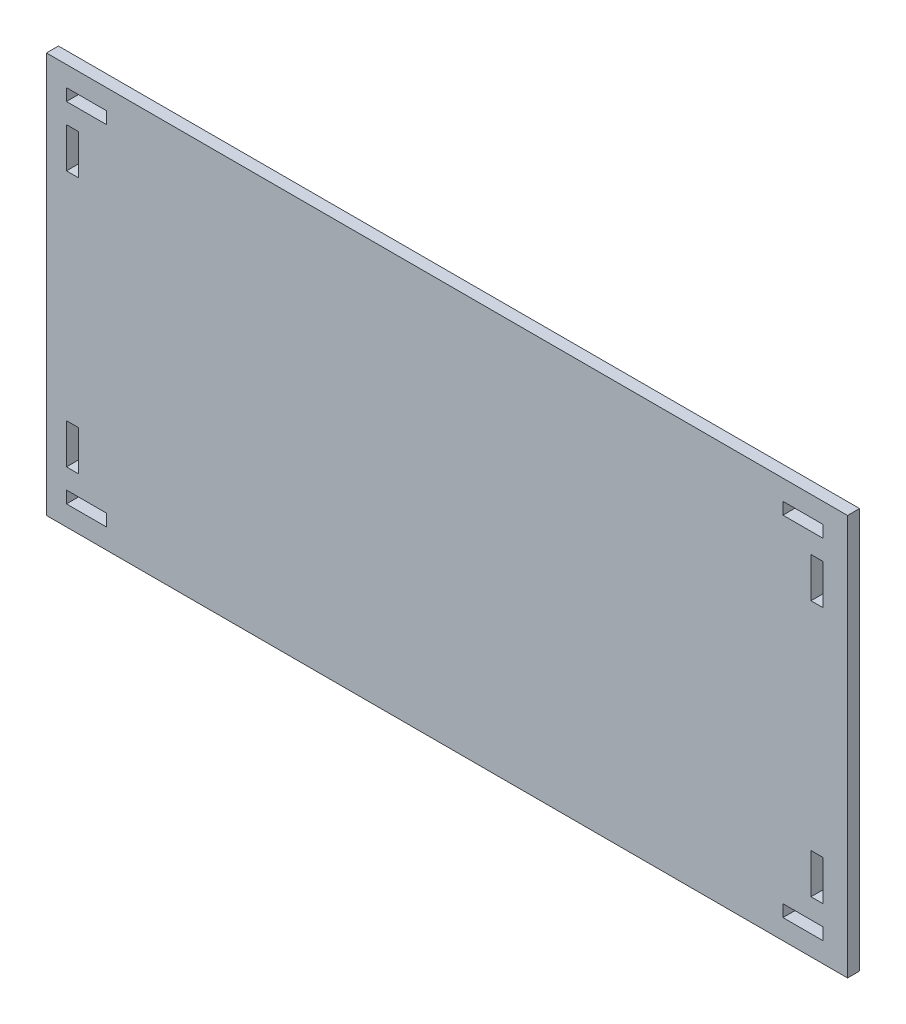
ISO-10303-21;
HEADER;
FILE_DESCRIPTION(('STEP AP214'),'2;1');
FILE_NAME('part.step','',(''),(''),'','','');
FILE_SCHEMA(('AUTOMOTIVE_DESIGN { 1 0 10303 214 1 1 1 1 }'));
ENDSEC;
DATA;
#1=APPLICATION_CONTEXT('core data for automotive mechanical design processes');
#2=APPLICATION_PROTOCOL_DEFINITION('international standard','automotive_design',2000,#1);
#3=PRODUCT_CONTEXT('',#1,'mechanical');
#4=PRODUCT('Part','Part','',(#3));
#5=PRODUCT_RELATED_PRODUCT_CATEGORY('part','',(#4));
#6=PRODUCT_DEFINITION_FORMATION('','',#4);
#7=PRODUCT_DEFINITION_CONTEXT('part definition',#1,'design');
#8=PRODUCT_DEFINITION('design','',#6,#7);
#9=PRODUCT_DEFINITION_SHAPE('','',#8);
#10=(LENGTH_UNIT() NAMED_UNIT(*) SI_UNIT(.MILLI.,.METRE.));
#11=(NAMED_UNIT(*) PLANE_ANGLE_UNIT() SI_UNIT($,.RADIAN.));
#12=(NAMED_UNIT(*) SI_UNIT($,.STERADIAN.) SOLID_ANGLE_UNIT());
#13=UNCERTAINTY_MEASURE_WITH_UNIT(LENGTH_MEASURE(1.E-05),#10,'distance_accuracy_value','');
#14=(GEOMETRIC_REPRESENTATION_CONTEXT(3) GLOBAL_UNCERTAINTY_ASSIGNED_CONTEXT((#13)) GLOBAL_UNIT_ASSIGNED_CONTEXT((#10,
#11,#12)) REPRESENTATION_CONTEXT('',''));
#15=CARTESIAN_POINT('',(0.,0.,0.));
#16=DIRECTION('',(0.,0.,1.));
#17=DIRECTION('',(1.,0.,0.));
#18=AXIS2_PLACEMENT_3D('',#15,#16,#17);
#19=CARTESIAN_POINT('',(0.,0.,3.));
#20=DIRECTION('',(0.,0.,-1.));
#21=DIRECTION('',(-1.,0.,0.));
#22=AXIS2_PLACEMENT_3D('',#19,#20,#21);
#23=PLANE('',#22);
#24=DIRECTION('',(0.,-1.,0.));
#25=VECTOR('',#24,1.);
#26=CARTESIAN_POINT('',(-38.5681584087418,54.3289702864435,3.));
#27=LINE('',#26,#25);
#28=CARTESIAN_POINT('',(-38.5681584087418,64.3289702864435,3.));
#29=VERTEX_POINT('',#28);
#30=CARTESIAN_POINT('',(-38.5681584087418,54.3289702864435,3.));
#31=VERTEX_POINT('',#30);
#32=EDGE_CURVE('E302',#29,#31,#27,.T.);
#33=ORIENTED_EDGE('',*,*,#32,.F.);
#34=DIRECTION('',(-1.,0.,0.));
#35=VECTOR('',#34,1.);
#36=CARTESIAN_POINT('',(-38.5681584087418,64.3289702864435,3.));
#37=LINE('',#36,#35);
#38=CARTESIAN_POINT('',(-35.5681584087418,64.3289702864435,3.));
#39=VERTEX_POINT('',#38);
#40=EDGE_CURVE('E310',#39,#29,#37,.T.);
#41=ORIENTED_EDGE('',*,*,#40,.F.);
#42=DIRECTION('',(0.,1.,0.));
#43=VECTOR('',#42,1.);
#44=CARTESIAN_POINT('',(-35.5681584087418,64.3289702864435,3.));
#45=LINE('',#44,#43);
#46=CARTESIAN_POINT('',(-35.5681584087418,54.3289702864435,3.));
#47=VERTEX_POINT('',#46);
#48=EDGE_CURVE('E307',#47,#39,#45,.T.);
#49=ORIENTED_EDGE('',*,*,#48,.F.);
#50=DIRECTION('',(1.,0.,0.));
#51=VECTOR('',#50,1.);
#52=CARTESIAN_POINT('',(-35.5681584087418,54.3289702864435,3.));
#53=LINE('',#52,#51);
#54=EDGE_CURVE('E304',#31,#47,#53,.T.);
#55=ORIENTED_EDGE('',*,*,#54,.F.);
#56=EDGE_LOOP('',(#33,#41,#49,#55));
#57=FACE_BOUND('',#56,.T.);
#58=DIRECTION('',(0.,-1.,0.));
#59=VECTOR('',#58,1.);
#60=CARTESIAN_POINT('',(-38.5681584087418,0.3289702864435,3.));
#61=LINE('',#60,#59);
#62=CARTESIAN_POINT('',(-38.5681584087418,0.3289702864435,3.));
#63=VERTEX_POINT('',#62);
#64=CARTESIAN_POINT('',(-38.5681584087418,-9.6710297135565,3.));
#65=VERTEX_POINT('',#64);
#66=EDGE_CURVE('E364',#63,#65,#61,.T.);
#67=ORIENTED_EDGE('',*,*,#66,.F.);
#68=DIRECTION('',(-1.,0.,0.));
#69=VECTOR('',#68,1.);
#70=CARTESIAN_POINT('',(-35.5681584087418,0.3289702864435,3.));
#71=LINE('',#70,#69);
#72=CARTESIAN_POINT('',(-35.5681584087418,0.3289702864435,3.));
#73=VERTEX_POINT('',#72);
#74=EDGE_CURVE('E372',#73,#63,#71,.T.);
#75=ORIENTED_EDGE('',*,*,#74,.F.);
#76=DIRECTION('',(0.,1.,0.));
#77=VECTOR('',#76,1.);
#78=CARTESIAN_POINT('',(-35.5681584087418,-9.6710297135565,3.));
#79=LINE('',#78,#77);
#80=CARTESIAN_POINT('',(-35.5681584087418,-9.6710297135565,3.));
#81=VERTEX_POINT('',#80);
#82=EDGE_CURVE('E369',#81,#73,#79,.T.);
#83=ORIENTED_EDGE('',*,*,#82,.F.);
#84=DIRECTION('',(1.,0.,0.));
#85=VECTOR('',#84,1.);
#86=CARTESIAN_POINT('',(-38.5681584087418,-9.6710297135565,3.));
#87=LINE('',#86,#85);
#88=EDGE_CURVE('E366',#65,#81,#87,.T.);
#89=ORIENTED_EDGE('',*,*,#88,.F.);
#90=EDGE_LOOP('',(#67,#75,#83,#89));
#91=FACE_BOUND('',#90,.T.);
#92=DIRECTION('',(-1.,0.,0.));
#93=VECTOR('',#92,1.);
#94=CARTESIAN_POINT('',(140.303700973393,72.3289702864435,3.));
#95=LINE('',#94,#93);
#96=CARTESIAN_POINT('',(150.303700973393,72.3289702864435,3.));
#97=VERTEX_POINT('',#96);
#98=CARTESIAN_POINT('',(140.303700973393,72.3289702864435,3.));
#99=VERTEX_POINT('',#98);
#100=EDGE_CURVE('E426',#97,#99,#95,.T.);
#101=ORIENTED_EDGE('',*,*,#100,.F.);
#102=DIRECTION('',(0.,1.,0.));
#103=VECTOR('',#102,1.);
#104=CARTESIAN_POINT('',(150.303700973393,72.3289702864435,3.));
#105=LINE('',#104,#103);
#106=CARTESIAN_POINT('',(150.303700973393,69.3289702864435,3.));
#107=VERTEX_POINT('',#106);
#108=EDGE_CURVE('E434',#107,#97,#105,.T.);
#109=ORIENTED_EDGE('',*,*,#108,.F.);
#110=DIRECTION('',(1.,0.,0.));
#111=VECTOR('',#110,1.);
#112=CARTESIAN_POINT('',(150.303700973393,69.3289702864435,3.));
#113=LINE('',#112,#111);
#114=CARTESIAN_POINT('',(140.303700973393,69.3289702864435,3.));
#115=VERTEX_POINT('',#114);
#116=EDGE_CURVE('E431',#115,#107,#113,.T.);
#117=ORIENTED_EDGE('',*,*,#116,.F.);
#118=DIRECTION('',(0.,-1.,0.));
#119=VECTOR('',#118,1.);
#120=CARTESIAN_POINT('',(140.303700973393,69.3289702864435,3.));
#121=LINE('',#120,#119);
#122=EDGE_CURVE('E428',#99,#115,#121,.T.);
#123=ORIENTED_EDGE('',*,*,#122,.F.);
#124=EDGE_LOOP('',(#101,#109,#117,#123));
#125=FACE_BOUND('',#124,.T.);
#126=DIRECTION('',(0.,-1.,0.));
#127=VECTOR('',#126,1.);
#128=CARTESIAN_POINT('',(-38.5681584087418,69.3289702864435,3.));
#129=LINE('',#128,#127);
#130=CARTESIAN_POINT('',(-38.5681584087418,72.3289702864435,3.));
#131=VERTEX_POINT('',#130);
#132=CARTESIAN_POINT('',(-38.5681584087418,69.3289702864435,3.));
#133=VERTEX_POINT('',#132);
#134=EDGE_CURVE('E488',#131,#133,#129,.T.);
#135=ORIENTED_EDGE('',*,*,#134,.F.);
#136=DIRECTION('',(-1.,0.,0.));
#137=VECTOR('',#136,1.);
#138=CARTESIAN_POINT('',(-38.5681584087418,72.3289702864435,3.));
#139=LINE('',#138,#137);
#140=CARTESIAN_POINT('',(-28.5681584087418,72.3289702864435,3.));
#141=VERTEX_POINT('',#140);
#142=EDGE_CURVE('E496',#141,#131,#139,.T.);
#143=ORIENTED_EDGE('',*,*,#142,.F.);
#144=DIRECTION('',(0.,1.,0.));
#145=VECTOR('',#144,1.);
#146=CARTESIAN_POINT('',(-28.5681584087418,72.3289702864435,3.));
#147=LINE('',#146,#145);
#148=CARTESIAN_POINT('',(-28.5681584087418,69.3289702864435,3.));
#149=VERTEX_POINT('',#148);
#150=EDGE_CURVE('E493',#149,#141,#147,.T.);
#151=ORIENTED_EDGE('',*,*,#150,.F.);
#152=DIRECTION('',(1.,0.,0.));
#153=VECTOR('',#152,1.);
#154=CARTESIAN_POINT('',(-28.5681584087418,69.3289702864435,3.));
#155=LINE('',#154,#153);
#156=EDGE_CURVE('E490',#133,#149,#155,.T.);
#157=ORIENTED_EDGE('',*,*,#156,.F.);
#158=EDGE_LOOP('',(#135,#143,#151,#157));
#159=FACE_BOUND('',#158,.T.);
#160=DIRECTION('',(0.,-1.,0.));
#161=VECTOR('',#160,1.);
#162=CARTESIAN_POINT('',(-43.5681584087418,-22.6710297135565,3.));
#163=LINE('',#162,#161);
#164=CARTESIAN_POINT('',(-43.5681584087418,77.3289702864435,3.));
#165=VERTEX_POINT('',#164);
#166=CARTESIAN_POINT('',(-43.5681584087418,-22.6710297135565,3.));
#167=VERTEX_POINT('',#166);
#168=EDGE_CURVE('E519',#165,#167,#163,.T.);
#169=ORIENTED_EDGE('',*,*,#168,.T.);
#170=DIRECTION('',(1.,0.,0.));
#171=VECTOR('',#170,1.);
#172=CARTESIAN_POINT('',(-43.5681584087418,-22.6710297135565,3.));
#173=LINE('',#172,#171);
#174=CARTESIAN_POINT('',(156.431841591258,-22.6710297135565,3.));
#175=VERTEX_POINT('',#174);
#176=EDGE_CURVE('E522',#167,#175,#173,.T.);
#177=ORIENTED_EDGE('',*,*,#176,.T.);
#178=DIRECTION('',(0.,1.,0.));
#179=VECTOR('',#178,1.);
#180=CARTESIAN_POINT('',(156.431841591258,77.3289702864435,3.));
#181=LINE('',#180,#179);
#182=CARTESIAN_POINT('',(156.431841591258,77.3289702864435,3.));
#183=VERTEX_POINT('',#182);
#184=EDGE_CURVE('E525',#175,#183,#181,.T.);
#185=ORIENTED_EDGE('',*,*,#184,.T.);
#186=DIRECTION('',(-1.,0.,0.));
#187=VECTOR('',#186,1.);
#188=CARTESIAN_POINT('',(-43.5681584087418,77.3289702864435,3.));
#189=LINE('',#188,#187);
#190=EDGE_CURVE('E527',#183,#165,#189,.T.);
#191=ORIENTED_EDGE('',*,*,#190,.T.);
#192=EDGE_LOOP('',(#169,#177,#185,#191));
#193=FACE_BOUND('',#192,.T.);
#194=DIRECTION('',(0.,-1.,0.));
#195=VECTOR('',#194,1.);
#196=CARTESIAN_POINT('',(-38.5681584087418,-14.6710297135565,3.));
#197=LINE('',#196,#195);
#198=CARTESIAN_POINT('',(-38.5681584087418,-14.6710297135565,3.));
#199=VERTEX_POINT('',#198);
#200=CARTESIAN_POINT('',(-38.5681584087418,-17.6710297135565,3.));
#201=VERTEX_POINT('',#200);
#202=EDGE_CURVE('E457',#199,#201,#197,.T.);
#203=ORIENTED_EDGE('',*,*,#202,.F.);
#204=DIRECTION('',(-1.,0.,0.));
#205=VECTOR('',#204,1.);
#206=CARTESIAN_POINT('',(-28.5681584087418,-14.6710297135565,3.));
#207=LINE('',#206,#205);
#208=CARTESIAN_POINT('',(-28.5681584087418,-14.6710297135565,3.));
#209=VERTEX_POINT('',#208);
#210=EDGE_CURVE('E465',#209,#199,#207,.T.);
#211=ORIENTED_EDGE('',*,*,#210,.F.);
#212=DIRECTION('',(0.,1.,0.));
#213=VECTOR('',#212,1.);
#214=CARTESIAN_POINT('',(-28.5681584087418,-17.6710297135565,3.));
#215=LINE('',#214,#213);
#216=CARTESIAN_POINT('',(-28.5681584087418,-17.6710297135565,3.));
#217=VERTEX_POINT('',#216);
#218=EDGE_CURVE('E462',#217,#209,#215,.T.);
#219=ORIENTED_EDGE('',*,*,#218,.F.);
#220=DIRECTION('',(1.,0.,0.));
#221=VECTOR('',#220,1.);
#222=CARTESIAN_POINT('',(-38.5681584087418,-17.6710297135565,3.));
#223=LINE('',#222,#221);
#224=EDGE_CURVE('E459',#201,#217,#223,.T.);
#225=ORIENTED_EDGE('',*,*,#224,.F.);
#226=EDGE_LOOP('',(#203,#211,#219,#225));
#227=FACE_BOUND('',#226,.T.);
#228=DIRECTION('',(0.,1.,0.));
#229=VECTOR('',#228,1.);
#230=CARTESIAN_POINT('',(150.303700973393,-14.6710297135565,3.));
#231=LINE('',#230,#229);
#232=CARTESIAN_POINT('',(150.303700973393,-17.6710297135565,3.));
#233=VERTEX_POINT('',#232);
#234=CARTESIAN_POINT('',(150.303700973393,-14.6710297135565,3.));
#235=VERTEX_POINT('',#234);
#236=EDGE_CURVE('E395',#233,#235,#231,.T.);
#237=ORIENTED_EDGE('',*,*,#236,.F.);
#238=DIRECTION('',(1.,0.,0.));
#239=VECTOR('',#238,1.);
#240=CARTESIAN_POINT('',(150.303700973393,-17.6710297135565,3.));
#241=LINE('',#240,#239);
#242=CARTESIAN_POINT('',(140.303700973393,-17.6710297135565,3.));
#243=VERTEX_POINT('',#242);
#244=EDGE_CURVE('E403',#243,#233,#241,.T.);
#245=ORIENTED_EDGE('',*,*,#244,.F.);
#246=DIRECTION('',(0.,-1.,0.));
#247=VECTOR('',#246,1.);
#248=CARTESIAN_POINT('',(140.303700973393,-17.6710297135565,3.));
#249=LINE('',#248,#247);
#250=CARTESIAN_POINT('',(140.303700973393,-14.6710297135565,3.));
#251=VERTEX_POINT('',#250);
#252=EDGE_CURVE('E400',#251,#243,#249,.T.);
#253=ORIENTED_EDGE('',*,*,#252,.F.);
#254=DIRECTION('',(-1.,0.,0.));
#255=VECTOR('',#254,1.);
#256=CARTESIAN_POINT('',(140.303700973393,-14.6710297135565,3.));
#257=LINE('',#256,#255);
#258=EDGE_CURVE('E397',#235,#251,#257,.T.);
#259=ORIENTED_EDGE('',*,*,#258,.F.);
#260=EDGE_LOOP('',(#237,#245,#253,#259));
#261=FACE_BOUND('',#260,.T.);
#262=DIRECTION('',(-1.,0.,0.));
#263=VECTOR('',#262,1.);
#264=CARTESIAN_POINT('',(147.303700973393,64.3289702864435,3.));
#265=LINE('',#264,#263);
#266=CARTESIAN_POINT('',(150.303700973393,64.3289702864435,3.));
#267=VERTEX_POINT('',#266);
#268=CARTESIAN_POINT('',(147.303700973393,64.3289702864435,3.));
#269=VERTEX_POINT('',#268);
#270=EDGE_CURVE('E333',#267,#269,#265,.T.);
#271=ORIENTED_EDGE('',*,*,#270,.F.);
#272=DIRECTION('',(0.,1.,0.));
#273=VECTOR('',#272,1.);
#274=CARTESIAN_POINT('',(150.303700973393,64.3289702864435,3.));
#275=LINE('',#274,#273);
#276=CARTESIAN_POINT('',(150.303700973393,54.3289702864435,3.));
#277=VERTEX_POINT('',#276);
#278=EDGE_CURVE('E341',#277,#267,#275,.T.);
#279=ORIENTED_EDGE('',*,*,#278,.F.);
#280=DIRECTION('',(1.,0.,0.));
#281=VECTOR('',#280,1.);
#282=CARTESIAN_POINT('',(150.303700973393,54.3289702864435,3.));
#283=LINE('',#282,#281);
#284=CARTESIAN_POINT('',(147.303700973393,54.3289702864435,3.));
#285=VERTEX_POINT('',#284);
#286=EDGE_CURVE('E338',#285,#277,#283,.T.);
#287=ORIENTED_EDGE('',*,*,#286,.F.);
#288=DIRECTION('',(0.,-1.,0.));
#289=VECTOR('',#288,1.);
#290=CARTESIAN_POINT('',(147.303700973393,54.3289702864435,3.));
#291=LINE('',#290,#289);
#292=EDGE_CURVE('E335',#269,#285,#291,.T.);
#293=ORIENTED_EDGE('',*,*,#292,.F.);
#294=EDGE_LOOP('',(#271,#279,#287,#293));
#295=FACE_BOUND('',#294,.T.);
#296=DIRECTION('',(1.,0.,0.));
#297=VECTOR('',#296,1.);
#298=CARTESIAN_POINT('',(147.303700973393,-9.6710297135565,3.));
#299=LINE('',#298,#297);
#300=CARTESIAN_POINT('',(147.303700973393,-9.6710297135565,3.));
#301=VERTEX_POINT('',#300);
#302=CARTESIAN_POINT('',(150.303700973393,-9.6710297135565,3.));
#303=VERTEX_POINT('',#302);
#304=EDGE_CURVE('E266',#301,#303,#299,.T.);
#305=ORIENTED_EDGE('',*,*,#304,.F.);
#306=DIRECTION('',(0.,-1.,0.));
#307=VECTOR('',#306,1.);
#308=CARTESIAN_POINT('',(147.303700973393,0.3289702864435,3.));
#309=LINE('',#308,#307);
#310=CARTESIAN_POINT('',(147.303700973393,0.3289702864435,3.));
#311=VERTEX_POINT('',#310);
#312=EDGE_CURVE('E288',#311,#301,#309,.T.);
#313=ORIENTED_EDGE('',*,*,#312,.F.);
#314=DIRECTION('',(-1.,0.,0.));
#315=VECTOR('',#314,1.);
#316=CARTESIAN_POINT('',(150.303700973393,0.3289702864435,3.));
#317=LINE('',#316,#315);
#318=CARTESIAN_POINT('',(150.303700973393,0.3289702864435,3.));
#319=VERTEX_POINT('',#318);
#320=EDGE_CURVE('E286',#319,#311,#317,.T.);
#321=ORIENTED_EDGE('',*,*,#320,.F.);
#322=DIRECTION('',(0.,1.,0.));
#323=VECTOR('',#322,1.);
#324=CARTESIAN_POINT('',(150.303700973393,-9.6710297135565,3.));
#325=LINE('',#324,#323);
#326=EDGE_CURVE('E274',#303,#319,#325,.T.);
#327=ORIENTED_EDGE('',*,*,#326,.F.);
#328=EDGE_LOOP('',(#305,#313,#321,#327));
#329=FACE_BOUND('',#328,.T.);
#330=ADVANCED_FACE('F33',(#57,#91,#125,#159,#193,#227,#261,#295,#329),#23,.F.);
#331=CARTESIAN_POINT('',(0.,0.,0.));
#332=DIRECTION('',(0.,0.,-1.));
#333=DIRECTION('',(-1.,0.,0.));
#334=AXIS2_PLACEMENT_3D('',#331,#332,#333);
#335=PLANE('',#334);
#336=DIRECTION('',(0.,-1.,0.));
#337=VECTOR('',#336,1.);
#338=CARTESIAN_POINT('',(-43.5681584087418,-22.6710297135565,0.));
#339=LINE('',#338,#337);
#340=CARTESIAN_POINT('',(-43.5681584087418,77.3289702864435,0.));
#341=VERTEX_POINT('',#340);
#342=CARTESIAN_POINT('',(-43.5681584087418,-22.6710297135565,0.));
#343=VERTEX_POINT('',#342);
#344=EDGE_CURVE('E518',#341,#343,#339,.T.);
#345=ORIENTED_EDGE('',*,*,#344,.F.);
#346=DIRECTION('',(-1.,0.,0.));
#347=VECTOR('',#346,1.);
#348=CARTESIAN_POINT('',(-43.5681584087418,77.3289702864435,0.));
#349=LINE('',#348,#347);
#350=CARTESIAN_POINT('',(156.431841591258,77.3289702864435,0.));
#351=VERTEX_POINT('',#350);
#352=EDGE_CURVE('E523',#351,#341,#349,.T.);
#353=ORIENTED_EDGE('',*,*,#352,.F.);
#354=DIRECTION('',(0.,1.,0.));
#355=VECTOR('',#354,1.);
#356=CARTESIAN_POINT('',(156.431841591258,77.3289702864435,0.));
#357=LINE('',#356,#355);
#358=CARTESIAN_POINT('',(156.431841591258,-22.6710297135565,0.));
#359=VERTEX_POINT('',#358);
#360=EDGE_CURVE('E534',#359,#351,#357,.T.);
#361=ORIENTED_EDGE('',*,*,#360,.F.);
#362=DIRECTION('',(1.,0.,0.));
#363=VECTOR('',#362,1.);
#364=CARTESIAN_POINT('',(-43.5681584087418,-22.6710297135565,0.));
#365=LINE('',#364,#363);
#366=EDGE_CURVE('E532',#343,#359,#365,.T.);
#367=ORIENTED_EDGE('',*,*,#366,.F.);
#368=EDGE_LOOP('',(#345,#353,#361,#367));
#369=FACE_BOUND('',#368,.T.);
#370=DIRECTION('',(-1.,0.,0.));
#371=VECTOR('',#370,1.);
#372=CARTESIAN_POINT('',(-38.5681584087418,72.3289702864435,0.));
#373=LINE('',#372,#371);
#374=CARTESIAN_POINT('',(-28.5681584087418,72.3289702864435,0.));
#375=VERTEX_POINT('',#374);
#376=CARTESIAN_POINT('',(-38.5681584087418,72.3289702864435,0.));
#377=VERTEX_POINT('',#376);
#378=EDGE_CURVE('E491',#375,#377,#373,.T.);
#379=ORIENTED_EDGE('',*,*,#378,.T.);
#380=DIRECTION('',(0.,-1.,0.));
#381=VECTOR('',#380,1.);
#382=CARTESIAN_POINT('',(-38.5681584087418,69.3289702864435,0.));
#383=LINE('',#382,#381);
#384=CARTESIAN_POINT('',(-38.5681584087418,69.3289702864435,0.));
#385=VERTEX_POINT('',#384);
#386=EDGE_CURVE('E487',#377,#385,#383,.T.);
#387=ORIENTED_EDGE('',*,*,#386,.T.);
#388=DIRECTION('',(1.,0.,0.));
#389=VECTOR('',#388,1.);
#390=CARTESIAN_POINT('',(-28.5681584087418,69.3289702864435,0.));
#391=LINE('',#390,#389);
#392=CARTESIAN_POINT('',(-28.5681584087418,69.3289702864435,0.));
#393=VERTEX_POINT('',#392);
#394=EDGE_CURVE('E501',#385,#393,#391,.T.);
#395=ORIENTED_EDGE('',*,*,#394,.T.);
#396=DIRECTION('',(0.,1.,0.));
#397=VECTOR('',#396,1.);
#398=CARTESIAN_POINT('',(-28.5681584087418,72.3289702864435,0.));
#399=LINE('',#398,#397);
#400=EDGE_CURVE('E504',#393,#375,#399,.T.);
#401=ORIENTED_EDGE('',*,*,#400,.T.);
#402=EDGE_LOOP('',(#379,#387,#395,#401));
#403=FACE_BOUND('',#402,.T.);
#404=DIRECTION('',(-1.,0.,0.));
#405=VECTOR('',#404,1.);
#406=CARTESIAN_POINT('',(-28.5681584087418,-14.6710297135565,0.));
#407=LINE('',#406,#405);
#408=CARTESIAN_POINT('',(-28.5681584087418,-14.6710297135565,0.));
#409=VERTEX_POINT('',#408);
#410=CARTESIAN_POINT('',(-38.5681584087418,-14.6710297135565,0.));
#411=VERTEX_POINT('',#410);
#412=EDGE_CURVE('E460',#409,#411,#407,.T.);
#413=ORIENTED_EDGE('',*,*,#412,.T.);
#414=DIRECTION('',(0.,-1.,0.));
#415=VECTOR('',#414,1.);
#416=CARTESIAN_POINT('',(-38.5681584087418,-14.6710297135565,0.));
#417=LINE('',#416,#415);
#418=CARTESIAN_POINT('',(-38.5681584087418,-17.6710297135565,0.));
#419=VERTEX_POINT('',#418);
#420=EDGE_CURVE('E456',#411,#419,#417,.T.);
#421=ORIENTED_EDGE('',*,*,#420,.T.);
#422=DIRECTION('',(1.,0.,0.));
#423=VECTOR('',#422,1.);
#424=CARTESIAN_POINT('',(-38.5681584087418,-17.6710297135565,0.));
#425=LINE('',#424,#423);
#426=CARTESIAN_POINT('',(-28.5681584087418,-17.6710297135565,0.));
#427=VERTEX_POINT('',#426);
#428=EDGE_CURVE('E470',#419,#427,#425,.T.);
#429=ORIENTED_EDGE('',*,*,#428,.T.);
#430=DIRECTION('',(0.,1.,0.));
#431=VECTOR('',#430,1.);
#432=CARTESIAN_POINT('',(-28.5681584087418,-17.6710297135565,0.));
#433=LINE('',#432,#431);
#434=EDGE_CURVE('E473',#427,#409,#433,.T.);
#435=ORIENTED_EDGE('',*,*,#434,.T.);
#436=EDGE_LOOP('',(#413,#421,#429,#435));
#437=FACE_BOUND('',#436,.T.);
#438=DIRECTION('',(0.,1.,0.));
#439=VECTOR('',#438,1.);
#440=CARTESIAN_POINT('',(150.303700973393,72.3289702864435,0.));
#441=LINE('',#440,#439);
#442=CARTESIAN_POINT('',(150.303700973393,69.3289702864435,0.));
#443=VERTEX_POINT('',#442);
#444=CARTESIAN_POINT('',(150.303700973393,72.3289702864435,0.));
#445=VERTEX_POINT('',#444);
#446=EDGE_CURVE('E429',#443,#445,#441,.T.);
#447=ORIENTED_EDGE('',*,*,#446,.T.);
#448=DIRECTION('',(-1.,0.,0.));
#449=VECTOR('',#448,1.);
#450=CARTESIAN_POINT('',(140.303700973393,72.3289702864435,0.));
#451=LINE('',#450,#449);
#452=CARTESIAN_POINT('',(140.303700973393,72.3289702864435,0.));
#453=VERTEX_POINT('',#452);
#454=EDGE_CURVE('E425',#445,#453,#451,.T.);
#455=ORIENTED_EDGE('',*,*,#454,.T.);
#456=DIRECTION('',(0.,-1.,0.));
#457=VECTOR('',#456,1.);
#458=CARTESIAN_POINT('',(140.303700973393,69.3289702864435,0.));
#459=LINE('',#458,#457);
#460=CARTESIAN_POINT('',(140.303700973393,69.3289702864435,0.));
#461=VERTEX_POINT('',#460);
#462=EDGE_CURVE('E439',#453,#461,#459,.T.);
#463=ORIENTED_EDGE('',*,*,#462,.T.);
#464=DIRECTION('',(1.,0.,0.));
#465=VECTOR('',#464,1.);
#466=CARTESIAN_POINT('',(150.303700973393,69.3289702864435,0.));
#467=LINE('',#466,#465);
#468=EDGE_CURVE('E442',#461,#443,#467,.T.);
#469=ORIENTED_EDGE('',*,*,#468,.T.);
#470=EDGE_LOOP('',(#447,#455,#463,#469));
#471=FACE_BOUND('',#470,.T.);
#472=DIRECTION('',(1.,0.,0.));
#473=VECTOR('',#472,1.);
#474=CARTESIAN_POINT('',(150.303700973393,-17.6710297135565,0.));
#475=LINE('',#474,#473);
#476=CARTESIAN_POINT('',(140.303700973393,-17.6710297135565,0.));
#477=VERTEX_POINT('',#476);
#478=CARTESIAN_POINT('',(150.303700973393,-17.6710297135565,0.));
#479=VERTEX_POINT('',#478);
#480=EDGE_CURVE('E398',#477,#479,#475,.T.);
#481=ORIENTED_EDGE('',*,*,#480,.T.);
#482=DIRECTION('',(0.,1.,0.));
#483=VECTOR('',#482,1.);
#484=CARTESIAN_POINT('',(150.303700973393,-14.6710297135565,0.));
#485=LINE('',#484,#483);
#486=CARTESIAN_POINT('',(150.303700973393,-14.6710297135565,0.));
#487=VERTEX_POINT('',#486);
#488=EDGE_CURVE('E394',#479,#487,#485,.T.);
#489=ORIENTED_EDGE('',*,*,#488,.T.);
#490=DIRECTION('',(-1.,0.,0.));
#491=VECTOR('',#490,1.);
#492=CARTESIAN_POINT('',(140.303700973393,-14.6710297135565,0.));
#493=LINE('',#492,#491);
#494=CARTESIAN_POINT('',(140.303700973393,-14.6710297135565,0.));
#495=VERTEX_POINT('',#494);
#496=EDGE_CURVE('E408',#487,#495,#493,.T.);
#497=ORIENTED_EDGE('',*,*,#496,.T.);
#498=DIRECTION('',(0.,-1.,0.));
#499=VECTOR('',#498,1.);
#500=CARTESIAN_POINT('',(140.303700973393,-17.6710297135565,0.));
#501=LINE('',#500,#499);
#502=EDGE_CURVE('E411',#495,#477,#501,.T.);
#503=ORIENTED_EDGE('',*,*,#502,.T.);
#504=EDGE_LOOP('',(#481,#489,#497,#503));
#505=FACE_BOUND('',#504,.T.);
#506=DIRECTION('',(-1.,0.,0.));
#507=VECTOR('',#506,1.);
#508=CARTESIAN_POINT('',(-35.5681584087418,0.3289702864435,0.));
#509=LINE('',#508,#507);
#510=CARTESIAN_POINT('',(-35.5681584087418,0.3289702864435,0.));
#511=VERTEX_POINT('',#510);
#512=CARTESIAN_POINT('',(-38.5681584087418,0.3289702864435,0.));
#513=VERTEX_POINT('',#512);
#514=EDGE_CURVE('E367',#511,#513,#509,.T.);
#515=ORIENTED_EDGE('',*,*,#514,.T.);
#516=DIRECTION('',(0.,-1.,0.));
#517=VECTOR('',#516,1.);
#518=CARTESIAN_POINT('',(-38.5681584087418,0.3289702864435,0.));
#519=LINE('',#518,#517);
#520=CARTESIAN_POINT('',(-38.5681584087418,-9.6710297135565,0.));
#521=VERTEX_POINT('',#520);
#522=EDGE_CURVE('E363',#513,#521,#519,.T.);
#523=ORIENTED_EDGE('',*,*,#522,.T.);
#524=DIRECTION('',(1.,0.,0.));
#525=VECTOR('',#524,1.);
#526=CARTESIAN_POINT('',(-38.5681584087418,-9.6710297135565,0.));
#527=LINE('',#526,#525);
#528=CARTESIAN_POINT('',(-35.5681584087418,-9.6710297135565,0.));
#529=VERTEX_POINT('',#528);
#530=EDGE_CURVE('E377',#521,#529,#527,.T.);
#531=ORIENTED_EDGE('',*,*,#530,.T.);
#532=DIRECTION('',(0.,1.,0.));
#533=VECTOR('',#532,1.);
#534=CARTESIAN_POINT('',(-35.5681584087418,-9.6710297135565,0.));
#535=LINE('',#534,#533);
#536=EDGE_CURVE('E380',#529,#511,#535,.T.);
#537=ORIENTED_EDGE('',*,*,#536,.T.);
#538=EDGE_LOOP('',(#515,#523,#531,#537));
#539=FACE_BOUND('',#538,.T.);
#540=DIRECTION('',(0.,1.,0.));
#541=VECTOR('',#540,1.);
#542=CARTESIAN_POINT('',(150.303700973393,64.3289702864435,0.));
#543=LINE('',#542,#541);
#544=CARTESIAN_POINT('',(150.303700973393,54.3289702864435,0.));
#545=VERTEX_POINT('',#544);
#546=CARTESIAN_POINT('',(150.303700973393,64.3289702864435,0.));
#547=VERTEX_POINT('',#546);
#548=EDGE_CURVE('E336',#545,#547,#543,.T.);
#549=ORIENTED_EDGE('',*,*,#548,.T.);
#550=DIRECTION('',(-1.,0.,0.));
#551=VECTOR('',#550,1.);
#552=CARTESIAN_POINT('',(147.303700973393,64.3289702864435,0.));
#553=LINE('',#552,#551);
#554=CARTESIAN_POINT('',(147.303700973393,64.3289702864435,0.));
#555=VERTEX_POINT('',#554);
#556=EDGE_CURVE('E332',#547,#555,#553,.T.);
#557=ORIENTED_EDGE('',*,*,#556,.T.);
#558=DIRECTION('',(0.,-1.,0.));
#559=VECTOR('',#558,1.);
#560=CARTESIAN_POINT('',(147.303700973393,54.3289702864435,0.));
#561=LINE('',#560,#559);
#562=CARTESIAN_POINT('',(147.303700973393,54.3289702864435,0.));
#563=VERTEX_POINT('',#562);
#564=EDGE_CURVE('E346',#555,#563,#561,.T.);
#565=ORIENTED_EDGE('',*,*,#564,.T.);
#566=DIRECTION('',(1.,0.,0.));
#567=VECTOR('',#566,1.);
#568=CARTESIAN_POINT('',(150.303700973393,54.3289702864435,0.));
#569=LINE('',#568,#567);
#570=EDGE_CURVE('E349',#563,#545,#569,.T.);
#571=ORIENTED_EDGE('',*,*,#570,.T.);
#572=EDGE_LOOP('',(#549,#557,#565,#571));
#573=FACE_BOUND('',#572,.T.);
#574=DIRECTION('',(-1.,0.,0.));
#575=VECTOR('',#574,1.);
#576=CARTESIAN_POINT('',(-38.5681584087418,64.3289702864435,0.));
#577=LINE('',#576,#575);
#578=CARTESIAN_POINT('',(-35.5681584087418,64.3289702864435,0.));
#579=VERTEX_POINT('',#578);
#580=CARTESIAN_POINT('',(-38.5681584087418,64.3289702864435,0.));
#581=VERTEX_POINT('',#580);
#582=EDGE_CURVE('E305',#579,#581,#577,.T.);
#583=ORIENTED_EDGE('',*,*,#582,.T.);
#584=DIRECTION('',(0.,-1.,0.));
#585=VECTOR('',#584,1.);
#586=CARTESIAN_POINT('',(-38.5681584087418,54.3289702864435,0.));
#587=LINE('',#586,#585);
#588=CARTESIAN_POINT('',(-38.5681584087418,54.3289702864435,0.));
#589=VERTEX_POINT('',#588);
#590=EDGE_CURVE('E282',#581,#589,#587,.T.);
#591=ORIENTED_EDGE('',*,*,#590,.T.);
#592=DIRECTION('',(1.,0.,0.));
#593=VECTOR('',#592,1.);
#594=CARTESIAN_POINT('',(-35.5681584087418,54.3289702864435,0.));
#595=LINE('',#594,#593);
#596=CARTESIAN_POINT('',(-35.5681584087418,54.3289702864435,0.));
#597=VERTEX_POINT('',#596);
#598=EDGE_CURVE('E315',#589,#597,#595,.T.);
#599=ORIENTED_EDGE('',*,*,#598,.T.);
#600=DIRECTION('',(0.,1.,0.));
#601=VECTOR('',#600,1.);
#602=CARTESIAN_POINT('',(-35.5681584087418,64.3289702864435,0.));
#603=LINE('',#602,#601);
#604=EDGE_CURVE('E318',#597,#579,#603,.T.);
#605=ORIENTED_EDGE('',*,*,#604,.T.);
#606=EDGE_LOOP('',(#583,#591,#599,#605));
#607=FACE_BOUND('',#606,.T.);
#608=DIRECTION('',(0.,-1.,0.));
#609=VECTOR('',#608,1.);
#610=CARTESIAN_POINT('',(147.303700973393,0.3289702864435,0.));
#611=LINE('',#610,#609);
#612=CARTESIAN_POINT('',(147.303700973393,0.3289702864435,0.));
#613=VERTEX_POINT('',#612);
#614=CARTESIAN_POINT('',(147.303700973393,-9.6710297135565,0.));
#615=VERTEX_POINT('',#614);
#616=EDGE_CURVE('E275',#613,#615,#611,.T.);
#617=ORIENTED_EDGE('',*,*,#616,.T.);
#618=DIRECTION('',(1.,0.,0.));
#619=VECTOR('',#618,1.);
#620=CARTESIAN_POINT('',(147.303700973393,-9.6710297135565,0.));
#621=LINE('',#620,#619);
#622=CARTESIAN_POINT('',(150.303700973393,-9.6710297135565,0.));
#623=VERTEX_POINT('',#622);
#624=EDGE_CURVE('E56',#615,#623,#621,.T.);
#625=ORIENTED_EDGE('',*,*,#624,.T.);
#626=DIRECTION('',(0.,1.,0.));
#627=VECTOR('',#626,1.);
#628=CARTESIAN_POINT('',(150.303700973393,-9.6710297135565,0.));
#629=LINE('',#628,#627);
#630=CARTESIAN_POINT('',(150.303700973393,0.3289702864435,0.));
#631=VERTEX_POINT('',#630);
#632=EDGE_CURVE('E281',#623,#631,#629,.T.);
#633=ORIENTED_EDGE('',*,*,#632,.T.);
#634=DIRECTION('',(-1.,0.,0.));
#635=VECTOR('',#634,1.);
#636=CARTESIAN_POINT('',(150.303700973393,0.3289702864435,0.));
#637=LINE('',#636,#635);
#638=EDGE_CURVE('E294',#631,#613,#637,.T.);
#639=ORIENTED_EDGE('',*,*,#638,.T.);
#640=EDGE_LOOP('',(#617,#625,#633,#639));
#641=FACE_BOUND('',#640,.T.);
#642=ADVANCED_FACE('F552',(#369,#403,#437,#471,#505,#539,#573,#607,#641),#335,.T.);
#643=CARTESIAN_POINT('',(-43.5681584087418,-22.6710297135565,3.));
#644=DIRECTION('',(1.,0.,0.));
#645=DIRECTION('',(0.,0.,-1.));
#646=AXIS2_PLACEMENT_3D('',#643,#644,#645);
#647=PLANE('',#646);
#648=ORIENTED_EDGE('',*,*,#344,.T.);
#649=DIRECTION('',(0.,0.,-1.));
#650=VECTOR('',#649,1.);
#651=CARTESIAN_POINT('',(-43.5681584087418,-22.6710297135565,3.));
#652=LINE('',#651,#650);
#653=EDGE_CURVE('E11',#167,#343,#652,.T.);
#654=ORIENTED_EDGE('',*,*,#653,.F.);
#655=ORIENTED_EDGE('',*,*,#168,.F.);
#656=DIRECTION('',(0.,0.,-1.));
#657=VECTOR('',#656,1.);
#658=CARTESIAN_POINT('',(-43.5681584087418,77.3289702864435,3.));
#659=LINE('',#658,#657);
#660=EDGE_CURVE('E529',#165,#341,#659,.T.);
#661=ORIENTED_EDGE('',*,*,#660,.T.);
#662=EDGE_LOOP('',(#648,#654,#655,#661));
#663=FACE_BOUND('',#662,.T.);
#664=ADVANCED_FACE('F35',(#663),#647,.F.);
#665=CARTESIAN_POINT('',(-43.5681584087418,-22.6710297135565,3.));
#666=DIRECTION('',(0.,1.,0.));
#667=DIRECTION('',(0.,0.,1.));
#668=AXIS2_PLACEMENT_3D('',#665,#666,#667);
#669=PLANE('',#668);
#670=ORIENTED_EDGE('',*,*,#366,.T.);
#671=DIRECTION('',(0.,0.,-1.));
#672=VECTOR('',#671,1.);
#673=CARTESIAN_POINT('',(156.431841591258,-22.6710297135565,3.));
#674=LINE('',#673,#672);
#675=EDGE_CURVE('E41',#175,#359,#674,.T.);
#676=ORIENTED_EDGE('',*,*,#675,.F.);
#677=ORIENTED_EDGE('',*,*,#176,.F.);
#678=ORIENTED_EDGE('',*,*,#653,.T.);
#679=EDGE_LOOP('',(#670,#676,#677,#678));
#680=FACE_BOUND('',#679,.T.);
#681=ADVANCED_FACE('F563',(#680),#669,.F.);
#682=CARTESIAN_POINT('',(156.431841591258,77.3289702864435,3.));
#683=DIRECTION('',(-1.,0.,0.));
#684=DIRECTION('',(0.,0.,1.));
#685=AXIS2_PLACEMENT_3D('',#682,#683,#684);
#686=PLANE('',#685);
#687=ORIENTED_EDGE('',*,*,#360,.T.);
#688=DIRECTION('',(0.,0.,-1.));
#689=VECTOR('',#688,1.);
#690=CARTESIAN_POINT('',(156.431841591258,77.3289702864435,3.));
#691=LINE('',#690,#689);
#692=EDGE_CURVE('E539',#183,#351,#691,.T.);
#693=ORIENTED_EDGE('',*,*,#692,.F.);
#694=ORIENTED_EDGE('',*,*,#184,.F.);
#695=ORIENTED_EDGE('',*,*,#675,.T.);
#696=EDGE_LOOP('',(#687,#693,#694,#695));
#697=FACE_BOUND('',#696,.T.);
#698=ADVANCED_FACE('F546',(#697),#686,.F.);
#699=CARTESIAN_POINT('',(-43.5681584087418,77.3289702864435,3.));
#700=DIRECTION('',(0.,-1.,0.));
#701=DIRECTION('',(0.,0.,-1.));
#702=AXIS2_PLACEMENT_3D('',#699,#700,#701);
#703=PLANE('',#702);
#704=ORIENTED_EDGE('',*,*,#352,.T.);
#705=ORIENTED_EDGE('',*,*,#660,.F.);
#706=ORIENTED_EDGE('',*,*,#190,.F.);
#707=ORIENTED_EDGE('',*,*,#692,.T.);
#708=EDGE_LOOP('',(#704,#705,#706,#707));
#709=FACE_BOUND('',#708,.T.);
#710=ADVANCED_FACE('F556',(#709),#703,.F.);
#711=CARTESIAN_POINT('',(-38.5681584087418,69.3289702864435,3.));
#712=DIRECTION('',(1.,0.,0.));
#713=DIRECTION('',(0.,0.,-1.));
#714=AXIS2_PLACEMENT_3D('',#711,#712,#713);
#715=PLANE('',#714);
#716=ORIENTED_EDGE('',*,*,#386,.F.);
#717=DIRECTION('',(0.,0.,-1.));
#718=VECTOR('',#717,1.);
#719=CARTESIAN_POINT('',(-38.5681584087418,72.3289702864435,3.));
#720=LINE('',#719,#718);
#721=EDGE_CURVE('E498',#131,#377,#720,.T.);
#722=ORIENTED_EDGE('',*,*,#721,.F.);
#723=ORIENTED_EDGE('',*,*,#134,.T.);
#724=DIRECTION('',(0.,0.,-1.));
#725=VECTOR('',#724,1.);
#726=CARTESIAN_POINT('',(-38.5681584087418,69.3289702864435,3.));
#727=LINE('',#726,#725);
#728=EDGE_CURVE('E515',#133,#385,#727,.T.);
#729=ORIENTED_EDGE('',*,*,#728,.T.);
#730=EDGE_LOOP('',(#716,#722,#723,#729));
#731=FACE_BOUND('',#730,.T.);
#732=ADVANCED_FACE('F580',(#731),#715,.T.);
#733=CARTESIAN_POINT('',(-28.5681584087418,69.3289702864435,3.));
#734=DIRECTION('',(0.,1.,0.));
#735=DIRECTION('',(0.,0.,1.));
#736=AXIS2_PLACEMENT_3D('',#733,#734,#735);
#737=PLANE('',#736);
#738=ORIENTED_EDGE('',*,*,#394,.F.);
#739=ORIENTED_EDGE('',*,*,#728,.F.);
#740=ORIENTED_EDGE('',*,*,#156,.T.);
#741=DIRECTION('',(0.,0.,-1.));
#742=VECTOR('',#741,1.);
#743=CARTESIAN_POINT('',(-28.5681584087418,69.3289702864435,3.));
#744=LINE('',#743,#742);
#745=EDGE_CURVE('E513',#149,#393,#744,.T.);
#746=ORIENTED_EDGE('',*,*,#745,.T.);
#747=EDGE_LOOP('',(#738,#739,#740,#746));
#748=FACE_BOUND('',#747,.T.);
#749=ADVANCED_FACE('F587',(#748),#737,.T.);
#750=CARTESIAN_POINT('',(-28.5681584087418,72.3289702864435,3.));
#751=DIRECTION('',(-1.,0.,0.));
#752=DIRECTION('',(0.,0.,1.));
#753=AXIS2_PLACEMENT_3D('',#750,#751,#752);
#754=PLANE('',#753);
#755=ORIENTED_EDGE('',*,*,#400,.F.);
#756=ORIENTED_EDGE('',*,*,#745,.F.);
#757=ORIENTED_EDGE('',*,*,#150,.T.);
#758=DIRECTION('',(0.,0.,-1.));
#759=VECTOR('',#758,1.);
#760=CARTESIAN_POINT('',(-28.5681584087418,72.3289702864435,3.));
#761=LINE('',#760,#759);
#762=EDGE_CURVE('E511',#141,#375,#761,.T.);
#763=ORIENTED_EDGE('',*,*,#762,.T.);
#764=EDGE_LOOP('',(#755,#756,#757,#763));
#765=FACE_BOUND('',#764,.T.);
#766=ADVANCED_FACE('F592',(#765),#754,.T.);
#767=CARTESIAN_POINT('',(-38.5681584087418,72.3289702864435,3.));
#768=DIRECTION('',(0.,-1.,0.));
#769=DIRECTION('',(0.,0.,-1.));
#770=AXIS2_PLACEMENT_3D('',#767,#768,#769);
#771=PLANE('',#770);
#772=ORIENTED_EDGE('',*,*,#378,.F.);
#773=ORIENTED_EDGE('',*,*,#762,.F.);
#774=ORIENTED_EDGE('',*,*,#142,.T.);
#775=ORIENTED_EDGE('',*,*,#721,.T.);
#776=EDGE_LOOP('',(#772,#773,#774,#775));
#777=FACE_BOUND('',#776,.T.);
#778=ADVANCED_FACE('F599',(#777),#771,.T.);
#779=CARTESIAN_POINT('',(-38.5681584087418,-14.6710297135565,3.));
#780=DIRECTION('',(1.,0.,0.));
#781=DIRECTION('',(0.,0.,-1.));
#782=AXIS2_PLACEMENT_3D('',#779,#780,#781);
#783=PLANE('',#782);
#784=ORIENTED_EDGE('',*,*,#420,.F.);
#785=DIRECTION('',(0.,0.,-1.));
#786=VECTOR('',#785,1.);
#787=CARTESIAN_POINT('',(-38.5681584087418,-14.6710297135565,3.));
#788=LINE('',#787,#786);
#789=EDGE_CURVE('E467',#199,#411,#788,.T.);
#790=ORIENTED_EDGE('',*,*,#789,.F.);
#791=ORIENTED_EDGE('',*,*,#202,.T.);
#792=DIRECTION('',(0.,0.,-1.));
#793=VECTOR('',#792,1.);
#794=CARTESIAN_POINT('',(-38.5681584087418,-17.6710297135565,3.));
#795=LINE('',#794,#793);
#796=EDGE_CURVE('E484',#201,#419,#795,.T.);
#797=ORIENTED_EDGE('',*,*,#796,.T.);
#798=EDGE_LOOP('',(#784,#790,#791,#797));
#799=FACE_BOUND('',#798,.T.);
#800=ADVANCED_FACE('F613',(#799),#783,.T.);
#801=CARTESIAN_POINT('',(-38.5681584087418,-17.6710297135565,3.));
#802=DIRECTION('',(0.,1.,0.));
#803=DIRECTION('',(0.,0.,1.));
#804=AXIS2_PLACEMENT_3D('',#801,#802,#803);
#805=PLANE('',#804);
#806=ORIENTED_EDGE('',*,*,#428,.F.);
#807=ORIENTED_EDGE('',*,*,#796,.F.);
#808=ORIENTED_EDGE('',*,*,#224,.T.);
#809=DIRECTION('',(0.,0.,-1.));
#810=VECTOR('',#809,1.);
#811=CARTESIAN_POINT('',(-28.5681584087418,-17.6710297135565,3.));
#812=LINE('',#811,#810);
#813=EDGE_CURVE('E482',#217,#427,#812,.T.);
#814=ORIENTED_EDGE('',*,*,#813,.T.);
#815=EDGE_LOOP('',(#806,#807,#808,#814));
#816=FACE_BOUND('',#815,.T.);
#817=ADVANCED_FACE('F618',(#816),#805,.T.);
#818=CARTESIAN_POINT('',(-28.5681584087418,-17.6710297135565,3.));
#819=DIRECTION('',(-1.,0.,0.));
#820=DIRECTION('',(0.,0.,1.));
#821=AXIS2_PLACEMENT_3D('',#818,#819,#820);
#822=PLANE('',#821);
#823=ORIENTED_EDGE('',*,*,#434,.F.);
#824=ORIENTED_EDGE('',*,*,#813,.F.);
#825=ORIENTED_EDGE('',*,*,#218,.T.);
#826=DIRECTION('',(0.,0.,-1.));
#827=VECTOR('',#826,1.);
#828=CARTESIAN_POINT('',(-28.5681584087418,-14.6710297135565,3.));
#829=LINE('',#828,#827);
#830=EDGE_CURVE('E480',#209,#409,#829,.T.);
#831=ORIENTED_EDGE('',*,*,#830,.T.);
#832=EDGE_LOOP('',(#823,#824,#825,#831));
#833=FACE_BOUND('',#832,.T.);
#834=ADVANCED_FACE('F622',(#833),#822,.T.);
#835=CARTESIAN_POINT('',(-28.5681584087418,-14.6710297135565,3.));
#836=DIRECTION('',(0.,-1.,0.));
#837=DIRECTION('',(0.,0.,-1.));
#838=AXIS2_PLACEMENT_3D('',#835,#836,#837);
#839=PLANE('',#838);
#840=ORIENTED_EDGE('',*,*,#412,.F.);
#841=ORIENTED_EDGE('',*,*,#830,.F.);
#842=ORIENTED_EDGE('',*,*,#210,.T.);
#843=ORIENTED_EDGE('',*,*,#789,.T.);
#844=EDGE_LOOP('',(#840,#841,#842,#843));
#845=FACE_BOUND('',#844,.T.);
#846=ADVANCED_FACE('F626',(#845),#839,.T.);
#847=CARTESIAN_POINT('',(140.303700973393,72.3289702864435,3.));
#848=DIRECTION('',(0.,-1.,0.));
#849=DIRECTION('',(0.,0.,-1.));
#850=AXIS2_PLACEMENT_3D('',#847,#848,#849);
#851=PLANE('',#850);
#852=ORIENTED_EDGE('',*,*,#454,.F.);
#853=DIRECTION('',(0.,0.,-1.));
#854=VECTOR('',#853,1.);
#855=CARTESIAN_POINT('',(150.303700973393,72.3289702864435,3.));
#856=LINE('',#855,#854);
#857=EDGE_CURVE('E436',#97,#445,#856,.T.);
#858=ORIENTED_EDGE('',*,*,#857,.F.);
#859=ORIENTED_EDGE('',*,*,#100,.T.);
#860=DIRECTION('',(0.,0.,-1.));
#861=VECTOR('',#860,1.);
#862=CARTESIAN_POINT('',(140.303700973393,72.3289702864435,3.));
#863=LINE('',#862,#861);
#864=EDGE_CURVE('E453',#99,#453,#863,.T.);
#865=ORIENTED_EDGE('',*,*,#864,.T.);
#866=EDGE_LOOP('',(#852,#858,#859,#865));
#867=FACE_BOUND('',#866,.T.);
#868=ADVANCED_FACE('F630',(#867),#851,.T.);
#869=CARTESIAN_POINT('',(140.303700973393,69.3289702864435,3.));
#870=DIRECTION('',(1.,0.,0.));
#871=DIRECTION('',(0.,0.,-1.));
#872=AXIS2_PLACEMENT_3D('',#869,#870,#871);
#873=PLANE('',#872);
#874=ORIENTED_EDGE('',*,*,#462,.F.);
#875=ORIENTED_EDGE('',*,*,#864,.F.);
#876=ORIENTED_EDGE('',*,*,#122,.T.);
#877=DIRECTION('',(0.,0.,-1.));
#878=VECTOR('',#877,1.);
#879=CARTESIAN_POINT('',(140.303700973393,69.3289702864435,3.));
#880=LINE('',#879,#878);
#881=EDGE_CURVE('E451',#115,#461,#880,.T.);
#882=ORIENTED_EDGE('',*,*,#881,.T.);
#883=EDGE_LOOP('',(#874,#875,#876,#882));
#884=FACE_BOUND('',#883,.T.);
#885=ADVANCED_FACE('F634',(#884),#873,.T.);
#886=CARTESIAN_POINT('',(150.303700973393,69.3289702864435,3.));
#887=DIRECTION('',(0.,1.,0.));
#888=DIRECTION('',(0.,0.,1.));
#889=AXIS2_PLACEMENT_3D('',#886,#887,#888);
#890=PLANE('',#889);
#891=ORIENTED_EDGE('',*,*,#468,.F.);
#892=ORIENTED_EDGE('',*,*,#881,.F.);
#893=ORIENTED_EDGE('',*,*,#116,.T.);
#894=DIRECTION('',(0.,0.,-1.));
#895=VECTOR('',#894,1.);
#896=CARTESIAN_POINT('',(150.303700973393,69.3289702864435,3.));
#897=LINE('',#896,#895);
#898=EDGE_CURVE('E449',#107,#443,#897,.T.);
#899=ORIENTED_EDGE('',*,*,#898,.T.);
#900=EDGE_LOOP('',(#891,#892,#893,#899));
#901=FACE_BOUND('',#900,.T.);
#902=ADVANCED_FACE('F638',(#901),#890,.T.);
#903=CARTESIAN_POINT('',(150.303700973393,72.3289702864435,3.));
#904=DIRECTION('',(-1.,0.,0.));
#905=DIRECTION('',(0.,0.,1.));
#906=AXIS2_PLACEMENT_3D('',#903,#904,#905);
#907=PLANE('',#906);
#908=ORIENTED_EDGE('',*,*,#446,.F.);
#909=ORIENTED_EDGE('',*,*,#898,.F.);
#910=ORIENTED_EDGE('',*,*,#108,.T.);
#911=ORIENTED_EDGE('',*,*,#857,.T.);
#912=EDGE_LOOP('',(#908,#909,#910,#911));
#913=FACE_BOUND('',#912,.T.);
#914=ADVANCED_FACE('F642',(#913),#907,.T.);
#915=CARTESIAN_POINT('',(150.303700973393,-14.6710297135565,3.));
#916=DIRECTION('',(-1.,0.,0.));
#917=DIRECTION('',(0.,0.,1.));
#918=AXIS2_PLACEMENT_3D('',#915,#916,#917);
#919=PLANE('',#918);
#920=ORIENTED_EDGE('',*,*,#488,.F.);
#921=DIRECTION('',(0.,0.,-1.));
#922=VECTOR('',#921,1.);
#923=CARTESIAN_POINT('',(150.303700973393,-17.6710297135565,3.));
#924=LINE('',#923,#922);
#925=EDGE_CURVE('E405',#233,#479,#924,.T.);
#926=ORIENTED_EDGE('',*,*,#925,.F.);
#927=ORIENTED_EDGE('',*,*,#236,.T.);
#928=DIRECTION('',(0.,0.,-1.));
#929=VECTOR('',#928,1.);
#930=CARTESIAN_POINT('',(150.303700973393,-14.6710297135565,3.));
#931=LINE('',#930,#929);
#932=EDGE_CURVE('E422',#235,#487,#931,.T.);
#933=ORIENTED_EDGE('',*,*,#932,.T.);
#934=EDGE_LOOP('',(#920,#926,#927,#933));
#935=FACE_BOUND('',#934,.T.);
#936=ADVANCED_FACE('F646',(#935),#919,.T.);
#937=CARTESIAN_POINT('',(140.303700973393,-14.6710297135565,3.));
#938=DIRECTION('',(0.,-1.,0.));
#939=DIRECTION('',(0.,0.,-1.));
#940=AXIS2_PLACEMENT_3D('',#937,#938,#939);
#941=PLANE('',#940);
#942=ORIENTED_EDGE('',*,*,#496,.F.);
#943=ORIENTED_EDGE('',*,*,#932,.F.);
#944=ORIENTED_EDGE('',*,*,#258,.T.);
#945=DIRECTION('',(0.,0.,-1.));
#946=VECTOR('',#945,1.);
#947=CARTESIAN_POINT('',(140.303700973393,-14.6710297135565,3.));
#948=LINE('',#947,#946);
#949=EDGE_CURVE('E420',#251,#495,#948,.T.);
#950=ORIENTED_EDGE('',*,*,#949,.T.);
#951=EDGE_LOOP('',(#942,#943,#944,#950));
#952=FACE_BOUND('',#951,.T.);
#953=ADVANCED_FACE('F650',(#952),#941,.T.);
#954=CARTESIAN_POINT('',(140.303700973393,-17.6710297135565,3.));
#955=DIRECTION('',(1.,0.,0.));
#956=DIRECTION('',(0.,0.,-1.));
#957=AXIS2_PLACEMENT_3D('',#954,#955,#956);
#958=PLANE('',#957);
#959=ORIENTED_EDGE('',*,*,#502,.F.);
#960=ORIENTED_EDGE('',*,*,#949,.F.);
#961=ORIENTED_EDGE('',*,*,#252,.T.);
#962=DIRECTION('',(0.,0.,-1.));
#963=VECTOR('',#962,1.);
#964=CARTESIAN_POINT('',(140.303700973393,-17.6710297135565,3.));
#965=LINE('',#964,#963);
#966=EDGE_CURVE('E418',#243,#477,#965,.T.);
#967=ORIENTED_EDGE('',*,*,#966,.T.);
#968=EDGE_LOOP('',(#959,#960,#961,#967));
#969=FACE_BOUND('',#968,.T.);
#970=ADVANCED_FACE('F654',(#969),#958,.T.);
#971=CARTESIAN_POINT('',(150.303700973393,-17.6710297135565,3.));
#972=DIRECTION('',(0.,1.,0.));
#973=DIRECTION('',(0.,0.,1.));
#974=AXIS2_PLACEMENT_3D('',#971,#972,#973);
#975=PLANE('',#974);
#976=ORIENTED_EDGE('',*,*,#480,.F.);
#977=ORIENTED_EDGE('',*,*,#966,.F.);
#978=ORIENTED_EDGE('',*,*,#244,.T.);
#979=ORIENTED_EDGE('',*,*,#925,.T.);
#980=EDGE_LOOP('',(#976,#977,#978,#979));
#981=FACE_BOUND('',#980,.T.);
#982=ADVANCED_FACE('F658',(#981),#975,.T.);
#983=CARTESIAN_POINT('',(-38.5681584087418,0.3289702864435,3.));
#984=DIRECTION('',(1.,0.,0.));
#985=DIRECTION('',(0.,0.,-1.));
#986=AXIS2_PLACEMENT_3D('',#983,#984,#985);
#987=PLANE('',#986);
#988=ORIENTED_EDGE('',*,*,#522,.F.);
#989=DIRECTION('',(0.,0.,-1.));
#990=VECTOR('',#989,1.);
#991=CARTESIAN_POINT('',(-38.5681584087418,0.3289702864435,3.));
#992=LINE('',#991,#990);
#993=EDGE_CURVE('E374',#63,#513,#992,.T.);
#994=ORIENTED_EDGE('',*,*,#993,.F.);
#995=ORIENTED_EDGE('',*,*,#66,.T.);
#996=DIRECTION('',(0.,0.,-1.));
#997=VECTOR('',#996,1.);
#998=CARTESIAN_POINT('',(-38.5681584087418,-9.6710297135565,3.));
#999=LINE('',#998,#997);
#1000=EDGE_CURVE('E391',#65,#521,#999,.T.);
#1001=ORIENTED_EDGE('',*,*,#1000,.T.);
#1002=EDGE_LOOP('',(#988,#994,#995,#1001));
#1003=FACE_BOUND('',#1002,.T.);
#1004=ADVANCED_FACE('F662',(#1003),#987,.T.);
#1005=CARTESIAN_POINT('',(-38.5681584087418,-9.6710297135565,3.));
#1006=DIRECTION('',(0.,1.,0.));
#1007=DIRECTION('',(0.,0.,1.));
#1008=AXIS2_PLACEMENT_3D('',#1005,#1006,#1007);
#1009=PLANE('',#1008);
#1010=ORIENTED_EDGE('',*,*,#530,.F.);
#1011=ORIENTED_EDGE('',*,*,#1000,.F.);
#1012=ORIENTED_EDGE('',*,*,#88,.T.);
#1013=DIRECTION('',(0.,0.,-1.));
#1014=VECTOR('',#1013,1.);
#1015=CARTESIAN_POINT('',(-35.5681584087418,-9.6710297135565,3.));
#1016=LINE('',#1015,#1014);
#1017=EDGE_CURVE('E389',#81,#529,#1016,.T.);
#1018=ORIENTED_EDGE('',*,*,#1017,.T.);
#1019=EDGE_LOOP('',(#1010,#1011,#1012,#1018));
#1020=FACE_BOUND('',#1019,.T.);
#1021=ADVANCED_FACE('F666',(#1020),#1009,.T.);
#1022=CARTESIAN_POINT('',(-35.5681584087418,-9.6710297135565,3.));
#1023=DIRECTION('',(-1.,0.,0.));
#1024=DIRECTION('',(0.,0.,1.));
#1025=AXIS2_PLACEMENT_3D('',#1022,#1023,#1024);
#1026=PLANE('',#1025);
#1027=ORIENTED_EDGE('',*,*,#536,.F.);
#1028=ORIENTED_EDGE('',*,*,#1017,.F.);
#1029=ORIENTED_EDGE('',*,*,#82,.T.);
#1030=DIRECTION('',(0.,0.,-1.));
#1031=VECTOR('',#1030,1.);
#1032=CARTESIAN_POINT('',(-35.5681584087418,0.3289702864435,3.));
#1033=LINE('',#1032,#1031);
#1034=EDGE_CURVE('E387',#73,#511,#1033,.T.);
#1035=ORIENTED_EDGE('',*,*,#1034,.T.);
#1036=EDGE_LOOP('',(#1027,#1028,#1029,#1035));
#1037=FACE_BOUND('',#1036,.T.);
#1038=ADVANCED_FACE('F670',(#1037),#1026,.T.);
#1039=CARTESIAN_POINT('',(-35.5681584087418,0.3289702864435,3.));
#1040=DIRECTION('',(0.,-1.,0.));
#1041=DIRECTION('',(0.,0.,-1.));
#1042=AXIS2_PLACEMENT_3D('',#1039,#1040,#1041);
#1043=PLANE('',#1042);
#1044=ORIENTED_EDGE('',*,*,#514,.F.);
#1045=ORIENTED_EDGE('',*,*,#1034,.F.);
#1046=ORIENTED_EDGE('',*,*,#74,.T.);
#1047=ORIENTED_EDGE('',*,*,#993,.T.);
#1048=EDGE_LOOP('',(#1044,#1045,#1046,#1047));
#1049=FACE_BOUND('',#1048,.T.);
#1050=ADVANCED_FACE('F674',(#1049),#1043,.T.);
#1051=CARTESIAN_POINT('',(147.303700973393,64.3289702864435,3.));
#1052=DIRECTION('',(0.,-1.,0.));
#1053=DIRECTION('',(0.,0.,-1.));
#1054=AXIS2_PLACEMENT_3D('',#1051,#1052,#1053);
#1055=PLANE('',#1054);
#1056=ORIENTED_EDGE('',*,*,#556,.F.);
#1057=DIRECTION('',(0.,0.,-1.));
#1058=VECTOR('',#1057,1.);
#1059=CARTESIAN_POINT('',(150.303700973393,64.3289702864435,3.));
#1060=LINE('',#1059,#1058);
#1061=EDGE_CURVE('E343',#267,#547,#1060,.T.);
#1062=ORIENTED_EDGE('',*,*,#1061,.F.);
#1063=ORIENTED_EDGE('',*,*,#270,.T.);
#1064=DIRECTION('',(0.,0.,-1.));
#1065=VECTOR('',#1064,1.);
#1066=CARTESIAN_POINT('',(147.303700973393,64.3289702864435,3.));
#1067=LINE('',#1066,#1065);
#1068=EDGE_CURVE('E360',#269,#555,#1067,.T.);
#1069=ORIENTED_EDGE('',*,*,#1068,.T.);
#1070=EDGE_LOOP('',(#1056,#1062,#1063,#1069));
#1071=FACE_BOUND('',#1070,.T.);
#1072=ADVANCED_FACE('F678',(#1071),#1055,.T.);
#1073=CARTESIAN_POINT('',(147.303700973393,54.3289702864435,3.));
#1074=DIRECTION('',(1.,0.,0.));
#1075=DIRECTION('',(0.,0.,-1.));
#1076=AXIS2_PLACEMENT_3D('',#1073,#1074,#1075);
#1077=PLANE('',#1076);
#1078=ORIENTED_EDGE('',*,*,#564,.F.);
#1079=ORIENTED_EDGE('',*,*,#1068,.F.);
#1080=ORIENTED_EDGE('',*,*,#292,.T.);
#1081=DIRECTION('',(0.,0.,-1.));
#1082=VECTOR('',#1081,1.);
#1083=CARTESIAN_POINT('',(147.303700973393,54.3289702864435,3.));
#1084=LINE('',#1083,#1082);
#1085=EDGE_CURVE('E358',#285,#563,#1084,.T.);
#1086=ORIENTED_EDGE('',*,*,#1085,.T.);
#1087=EDGE_LOOP('',(#1078,#1079,#1080,#1086));
#1088=FACE_BOUND('',#1087,.T.);
#1089=ADVANCED_FACE('F682',(#1088),#1077,.T.);
#1090=CARTESIAN_POINT('',(150.303700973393,54.3289702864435,3.));
#1091=DIRECTION('',(0.,1.,0.));
#1092=DIRECTION('',(0.,0.,1.));
#1093=AXIS2_PLACEMENT_3D('',#1090,#1091,#1092);
#1094=PLANE('',#1093);
#1095=ORIENTED_EDGE('',*,*,#570,.F.);
#1096=ORIENTED_EDGE('',*,*,#1085,.F.);
#1097=ORIENTED_EDGE('',*,*,#286,.T.);
#1098=DIRECTION('',(0.,0.,-1.));
#1099=VECTOR('',#1098,1.);
#1100=CARTESIAN_POINT('',(150.303700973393,54.3289702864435,3.));
#1101=LINE('',#1100,#1099);
#1102=EDGE_CURVE('E356',#277,#545,#1101,.T.);
#1103=ORIENTED_EDGE('',*,*,#1102,.T.);
#1104=EDGE_LOOP('',(#1095,#1096,#1097,#1103));
#1105=FACE_BOUND('',#1104,.T.);
#1106=ADVANCED_FACE('F686',(#1105),#1094,.T.);
#1107=CARTESIAN_POINT('',(150.303700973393,64.3289702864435,3.));
#1108=DIRECTION('',(-1.,0.,0.));
#1109=DIRECTION('',(0.,0.,1.));
#1110=AXIS2_PLACEMENT_3D('',#1107,#1108,#1109);
#1111=PLANE('',#1110);
#1112=ORIENTED_EDGE('',*,*,#548,.F.);
#1113=ORIENTED_EDGE('',*,*,#1102,.F.);
#1114=ORIENTED_EDGE('',*,*,#278,.T.);
#1115=ORIENTED_EDGE('',*,*,#1061,.T.);
#1116=EDGE_LOOP('',(#1112,#1113,#1114,#1115));
#1117=FACE_BOUND('',#1116,.T.);
#1118=ADVANCED_FACE('F690',(#1117),#1111,.T.);
#1119=CARTESIAN_POINT('',(-38.5681584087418,54.3289702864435,3.));
#1120=DIRECTION('',(1.,0.,0.));
#1121=DIRECTION('',(0.,0.,-1.));
#1122=AXIS2_PLACEMENT_3D('',#1119,#1120,#1121);
#1123=PLANE('',#1122);
#1124=ORIENTED_EDGE('',*,*,#590,.F.);
#1125=DIRECTION('',(0.,0.,-1.));
#1126=VECTOR('',#1125,1.);
#1127=CARTESIAN_POINT('',(-38.5681584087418,64.3289702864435,3.));
#1128=LINE('',#1127,#1126);
#1129=EDGE_CURVE('E312',#29,#581,#1128,.T.);
#1130=ORIENTED_EDGE('',*,*,#1129,.F.);
#1131=ORIENTED_EDGE('',*,*,#32,.T.);
#1132=DIRECTION('',(0.,0.,-1.));
#1133=VECTOR('',#1132,1.);
#1134=CARTESIAN_POINT('',(-38.5681584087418,54.3289702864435,3.));
#1135=LINE('',#1134,#1133);
#1136=EDGE_CURVE('E329',#31,#589,#1135,.T.);
#1137=ORIENTED_EDGE('',*,*,#1136,.T.);
#1138=EDGE_LOOP('',(#1124,#1130,#1131,#1137));
#1139=FACE_BOUND('',#1138,.T.);
#1140=ADVANCED_FACE('F694',(#1139),#1123,.T.);
#1141=CARTESIAN_POINT('',(-35.5681584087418,54.3289702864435,3.));
#1142=DIRECTION('',(0.,1.,0.));
#1143=DIRECTION('',(0.,0.,1.));
#1144=AXIS2_PLACEMENT_3D('',#1141,#1142,#1143);
#1145=PLANE('',#1144);
#1146=ORIENTED_EDGE('',*,*,#598,.F.);
#1147=ORIENTED_EDGE('',*,*,#1136,.F.);
#1148=ORIENTED_EDGE('',*,*,#54,.T.);
#1149=DIRECTION('',(0.,0.,-1.));
#1150=VECTOR('',#1149,1.);
#1151=CARTESIAN_POINT('',(-35.5681584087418,54.3289702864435,3.));
#1152=LINE('',#1151,#1150);
#1153=EDGE_CURVE('E327',#47,#597,#1152,.T.);
#1154=ORIENTED_EDGE('',*,*,#1153,.T.);
#1155=EDGE_LOOP('',(#1146,#1147,#1148,#1154));
#1156=FACE_BOUND('',#1155,.T.);
#1157=ADVANCED_FACE('F698',(#1156),#1145,.T.);
#1158=CARTESIAN_POINT('',(-35.5681584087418,64.3289702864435,3.));
#1159=DIRECTION('',(-1.,0.,0.));
#1160=DIRECTION('',(0.,0.,1.));
#1161=AXIS2_PLACEMENT_3D('',#1158,#1159,#1160);
#1162=PLANE('',#1161);
#1163=ORIENTED_EDGE('',*,*,#604,.F.);
#1164=ORIENTED_EDGE('',*,*,#1153,.F.);
#1165=ORIENTED_EDGE('',*,*,#48,.T.);
#1166=DIRECTION('',(0.,0.,-1.));
#1167=VECTOR('',#1166,1.);
#1168=CARTESIAN_POINT('',(-35.5681584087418,64.3289702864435,3.));
#1169=LINE('',#1168,#1167);
#1170=EDGE_CURVE('E325',#39,#579,#1169,.T.);
#1171=ORIENTED_EDGE('',*,*,#1170,.T.);
#1172=EDGE_LOOP('',(#1163,#1164,#1165,#1171));
#1173=FACE_BOUND('',#1172,.T.);
#1174=ADVANCED_FACE('F702',(#1173),#1162,.T.);
#1175=CARTESIAN_POINT('',(-38.5681584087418,64.3289702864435,3.));
#1176=DIRECTION('',(0.,-1.,0.));
#1177=DIRECTION('',(0.,0.,-1.));
#1178=AXIS2_PLACEMENT_3D('',#1175,#1176,#1177);
#1179=PLANE('',#1178);
#1180=ORIENTED_EDGE('',*,*,#582,.F.);
#1181=ORIENTED_EDGE('',*,*,#1170,.F.);
#1182=ORIENTED_EDGE('',*,*,#40,.T.);
#1183=ORIENTED_EDGE('',*,*,#1129,.T.);
#1184=EDGE_LOOP('',(#1180,#1181,#1182,#1183));
#1185=FACE_BOUND('',#1184,.T.);
#1186=ADVANCED_FACE('F706',(#1185),#1179,.T.);
#1187=CARTESIAN_POINT('',(147.303700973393,-9.6710297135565,3.));
#1188=DIRECTION('',(0.,1.,0.));
#1189=DIRECTION('',(0.,0.,1.));
#1190=AXIS2_PLACEMENT_3D('',#1187,#1188,#1189);
#1191=PLANE('',#1190);
#1192=ORIENTED_EDGE('',*,*,#624,.F.);
#1193=DIRECTION('',(0.,0.,-1.));
#1194=VECTOR('',#1193,1.);
#1195=CARTESIAN_POINT('',(147.303700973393,-9.6710297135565,3.));
#1196=LINE('',#1195,#1194);
#1197=EDGE_CURVE('E270',#301,#615,#1196,.T.);
#1198=ORIENTED_EDGE('',*,*,#1197,.F.);
#1199=ORIENTED_EDGE('',*,*,#304,.T.);
#1200=DIRECTION('',(0.,0.,-1.));
#1201=VECTOR('',#1200,1.);
#1202=CARTESIAN_POINT('',(150.303700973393,-9.6710297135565,3.));
#1203=LINE('',#1202,#1201);
#1204=EDGE_CURVE('E269',#303,#623,#1203,.T.);
#1205=ORIENTED_EDGE('',*,*,#1204,.T.);
#1206=EDGE_LOOP('',(#1192,#1198,#1199,#1205));
#1207=FACE_BOUND('',#1206,.T.);
#1208=ADVANCED_FACE('F268',(#1207),#1191,.T.);
#1209=CARTESIAN_POINT('',(150.303700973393,-9.6710297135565,3.));
#1210=DIRECTION('',(-1.,0.,0.));
#1211=DIRECTION('',(0.,0.,1.));
#1212=AXIS2_PLACEMENT_3D('',#1209,#1210,#1211);
#1213=PLANE('',#1212);
#1214=ORIENTED_EDGE('',*,*,#632,.F.);
#1215=ORIENTED_EDGE('',*,*,#1204,.F.);
#1216=ORIENTED_EDGE('',*,*,#326,.T.);
#1217=DIRECTION('',(0.,0.,-1.));
#1218=VECTOR('',#1217,1.);
#1219=CARTESIAN_POINT('',(150.303700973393,0.3289702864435,3.));
#1220=LINE('',#1219,#1218);
#1221=EDGE_CURVE('E283',#319,#631,#1220,.T.);
#1222=ORIENTED_EDGE('',*,*,#1221,.T.);
#1223=EDGE_LOOP('',(#1214,#1215,#1216,#1222));
#1224=FACE_BOUND('',#1223,.T.);
#1225=ADVANCED_FACE('F278',(#1224),#1213,.T.);
#1226=CARTESIAN_POINT('',(150.303700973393,0.3289702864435,3.));
#1227=DIRECTION('',(0.,-1.,0.));
#1228=DIRECTION('',(0.,0.,-1.));
#1229=AXIS2_PLACEMENT_3D('',#1226,#1227,#1228);
#1230=PLANE('',#1229);
#1231=ORIENTED_EDGE('',*,*,#638,.F.);
#1232=ORIENTED_EDGE('',*,*,#1221,.F.);
#1233=ORIENTED_EDGE('',*,*,#320,.T.);
#1234=DIRECTION('',(0.,0.,-1.));
#1235=VECTOR('',#1234,1.);
#1236=CARTESIAN_POINT('',(147.303700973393,0.3289702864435,3.));
#1237=LINE('',#1236,#1235);
#1238=EDGE_CURVE('E48',#311,#613,#1237,.T.);
#1239=ORIENTED_EDGE('',*,*,#1238,.T.);
#1240=EDGE_LOOP('',(#1231,#1232,#1233,#1239));
#1241=FACE_BOUND('',#1240,.T.);
#1242=ADVANCED_FACE('F715',(#1241),#1230,.T.);
#1243=CARTESIAN_POINT('',(147.303700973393,0.3289702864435,3.));
#1244=DIRECTION('',(1.,0.,0.));
#1245=DIRECTION('',(0.,0.,-1.));
#1246=AXIS2_PLACEMENT_3D('',#1243,#1244,#1245);
#1247=PLANE('',#1246);
#1248=ORIENTED_EDGE('',*,*,#616,.F.);
#1249=ORIENTED_EDGE('',*,*,#1238,.F.);
#1250=ORIENTED_EDGE('',*,*,#312,.T.);
#1251=ORIENTED_EDGE('',*,*,#1197,.T.);
#1252=EDGE_LOOP('',(#1248,#1249,#1250,#1251));
#1253=FACE_BOUND('',#1252,.T.);
#1254=ADVANCED_FACE('F718',(#1253),#1247,.T.);
#1255=CLOSED_SHELL('',(#330,#642,#664,#681,#698,#710,#732,#749,#766,#778,#800,#817,#834,#846,
#868,#885,#902,#914,#936,#953,#970,#982,#1004,#1021,#1038,#1050,#1072,#1089,#1106,#1118,#1140,
#1157,#1174,#1186,#1208,#1225,#1242,#1254));
#1256=MANIFOLD_SOLID_BREP('B2',#1255);
#1257=ADVANCED_BREP_SHAPE_REPRESENTATION('',(#18,#1256),#14);
#1258=SHAPE_DEFINITION_REPRESENTATION(#9,#1257);
ENDSEC;
END-ISO-10303-21;
